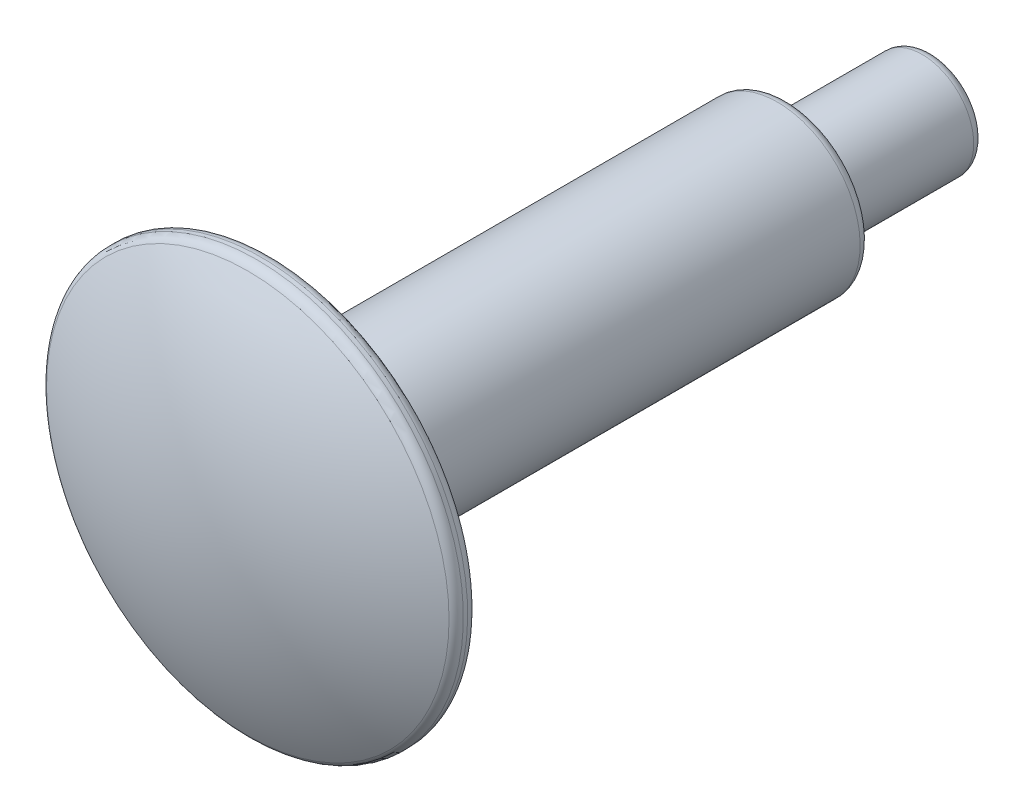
from build123d import *

# Parameters (mm, degrees)
FILLET_1_R = 0.5


with BuildPart() as part:
    # Sketch 1 → Revolve 1 (revolve)
    with BuildSketch(Plane(origin=(0, 0, 0), x_dir=(0, 0, -1), z_dir=(1, 0, 0)), mode=Mode.PRIVATE) as revolve_1_sk:
        with BuildLine():
            Line((-17.839745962, 0), (17.839745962, 0))
            Line((17.839745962, 0), (17.839745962, 2.5))
            Line((17.839745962, 2.5), (10.839745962, 2.5))
            Line((10.839745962, 2.5), (10.839745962, 4))
            Line((10.839745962, 4), (-14.160254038, 4))
            Line((-14.160254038, 4), (-14.160254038, 10))
            Line((-14.160254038, 10), (-15.160254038, 10))
            ThreePointArc((-15.160254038, 10), (-17.158262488, 5.176380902), (-17.839745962, 0))
        make_face()
    revolve(revolve_1_sk.sketch.rotate(Axis((0, 0, 17.839745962), (0, 0, -1)), 180), axis=Axis((0, 0, 17.839745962), (0, 0, -1)))

    # Fillet 1
    fillet_1_edges = [part.edges().sort_by_distance(p)[0] for p in [
        (0, 10, 15.160254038),
        (0, 10, 14.160254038),
        (0, 4, 14.160254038),
        (0, 4, -10.839745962),
        (0, 2.5, -10.839745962),
        (0, 2.5, -17.839745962),
    ]]
    fillet(fillet_1_edges, radius=FILLET_1_R)


solid = part.part
